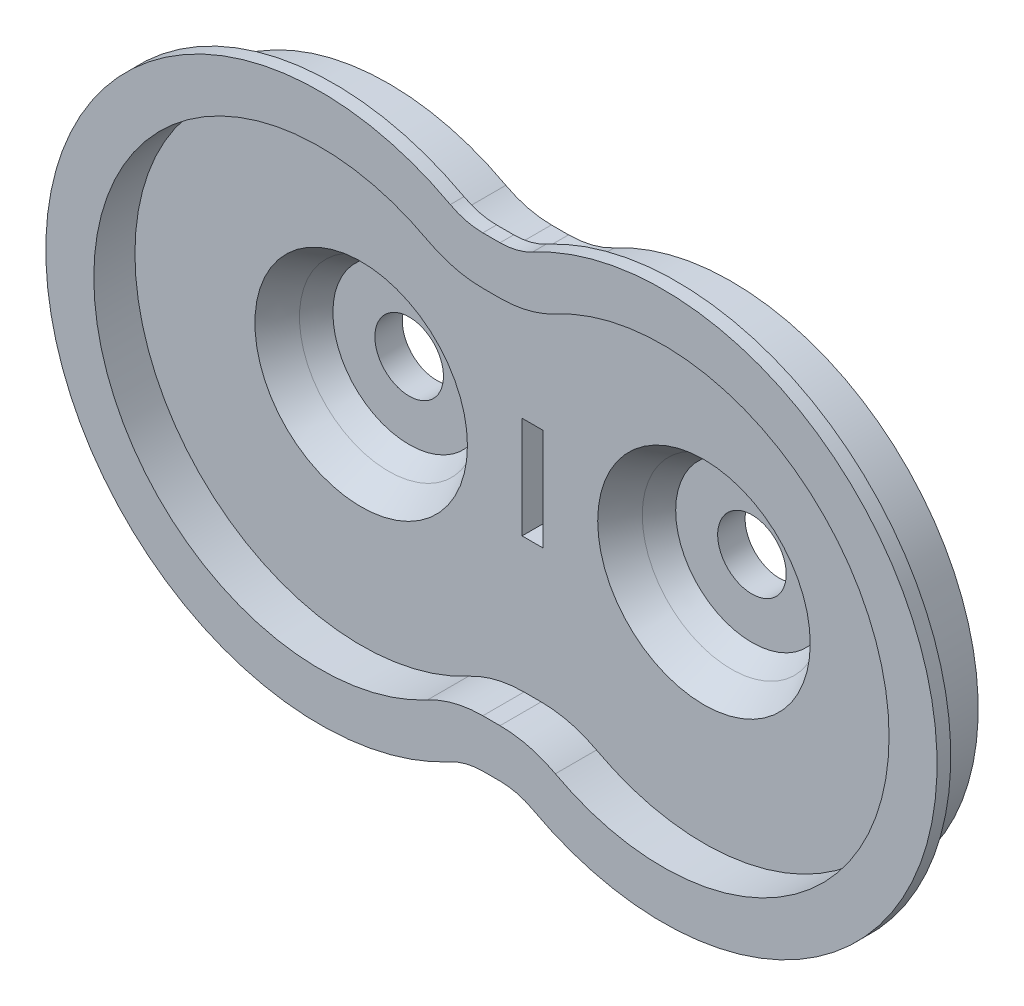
ISO-10303-21;
HEADER;
FILE_DESCRIPTION(('STEP AP214'),'2;1');
FILE_NAME('part.step','',(''),(''),'','','');
FILE_SCHEMA(('AUTOMOTIVE_DESIGN { 1 0 10303 214 1 1 1 1 }'));
ENDSEC;
DATA;
#1=APPLICATION_CONTEXT('core data for automotive mechanical design processes');
#2=APPLICATION_PROTOCOL_DEFINITION('international standard','automotive_design',2000,#1);
#3=PRODUCT_CONTEXT('',#1,'mechanical');
#4=PRODUCT('Part','Part','',(#3));
#5=PRODUCT_RELATED_PRODUCT_CATEGORY('part','',(#4));
#6=PRODUCT_DEFINITION_FORMATION('','',#4);
#7=PRODUCT_DEFINITION_CONTEXT('part definition',#1,'design');
#8=PRODUCT_DEFINITION('design','',#6,#7);
#9=PRODUCT_DEFINITION_SHAPE('','',#8);
#10=(LENGTH_UNIT() NAMED_UNIT(*) SI_UNIT(.MILLI.,.METRE.));
#11=(NAMED_UNIT(*) PLANE_ANGLE_UNIT() SI_UNIT($,.RADIAN.));
#12=(NAMED_UNIT(*) SI_UNIT($,.STERADIAN.) SOLID_ANGLE_UNIT());
#13=UNCERTAINTY_MEASURE_WITH_UNIT(LENGTH_MEASURE(1.E-05),#10,'distance_accuracy_value','');
#14=(GEOMETRIC_REPRESENTATION_CONTEXT(3) GLOBAL_UNCERTAINTY_ASSIGNED_CONTEXT((#13)) GLOBAL_UNIT_ASSIGNED_CONTEXT((#10,
#11,#12)) REPRESENTATION_CONTEXT('',''));
#15=CARTESIAN_POINT('',(0.,0.,0.));
#16=DIRECTION('',(0.,0.,1.));
#17=DIRECTION('',(1.,0.,0.));
#18=AXIS2_PLACEMENT_3D('',#15,#16,#17);
#19=CARTESIAN_POINT('',(0.625657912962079,22.,-4.));
#20=DIRECTION('',(0.,0.,1.));
#21=DIRECTION('',(1.,0.,0.));
#22=AXIS2_PLACEMENT_3D('',#19,#20,#21);
#23=CYLINDRICAL_SURFACE('',#22,7.00030465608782);
#24=DIRECTION('',(0.,0.,1.));
#25=VECTOR('',#24,1.);
#26=CARTESIAN_POINT('',(0.625657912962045,14.9996953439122,-4.));
#27=LINE('',#26,#25);
#28=CARTESIAN_POINT('',(0.625657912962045,14.9996953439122,-4.));
#29=VERTEX_POINT('',#28);
#30=CARTESIAN_POINT('',(0.625657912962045,14.9996953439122,0.));
#31=VERTEX_POINT('',#30);
#32=EDGE_CURVE('E428',#29,#31,#27,.T.);
#33=ORIENTED_EDGE('',*,*,#32,.T.);
#34=CARTESIAN_POINT('',(0.625657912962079,22.,0.));
#35=DIRECTION('',(0.,0.,-1.));
#36=DIRECTION('',(1.,0.,0.));
#37=AXIS2_PLACEMENT_3D('',#34,#35,#36);
#38=CIRCLE('',#37,7.00030465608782);
#39=CARTESIAN_POINT('',(3.95061840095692,15.8397319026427,0.));
#40=VERTEX_POINT('',#39);
#41=EDGE_CURVE('E314',#40,#31,#38,.T.);
#42=ORIENTED_EDGE('',*,*,#41,.F.);
#43=DIRECTION('',(0.,0.,1.));
#44=VECTOR('',#43,1.);
#45=CARTESIAN_POINT('',(3.95061840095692,15.8397319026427,-4.));
#46=LINE('',#45,#44);
#47=CARTESIAN_POINT('',(3.95061840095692,15.8397319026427,-4.));
#48=VERTEX_POINT('',#47);
#49=EDGE_CURVE('E458',#48,#40,#46,.T.);
#50=ORIENTED_EDGE('',*,*,#49,.F.);
#51=CARTESIAN_POINT('',(0.625657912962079,22.,-4.));
#52=DIRECTION('',(0.,0.,-1.));
#53=DIRECTION('',(1.,0.,0.));
#54=AXIS2_PLACEMENT_3D('',#51,#52,#53);
#55=CIRCLE('',#54,7.00030465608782);
#56=EDGE_CURVE('E35',#48,#29,#55,.T.);
#57=ORIENTED_EDGE('',*,*,#56,.T.);
#58=EDGE_LOOP('',(#33,#42,#50,#57));
#59=FACE_BOUND('',#58,.T.);
#60=ADVANCED_FACE('F31',(#59),#23,.F.);
#61=CARTESIAN_POINT('',(12.5,0.,-4.));
#62=DIRECTION('',(0.,0.,1.));
#63=DIRECTION('',(1.,0.,0.));
#64=AXIS2_PLACEMENT_3D('',#61,#62,#63);
#65=CYLINDRICAL_SURFACE('',#64,17.9996953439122);
#66=ORIENTED_EDGE('',*,*,#49,.T.);
#67=CARTESIAN_POINT('',(12.5,0.,0.));
#68=DIRECTION('',(0.,0.,1.));
#69=DIRECTION('',(1.,0.,0.));
#70=AXIS2_PLACEMENT_3D('',#67,#68,#69);
#71=CIRCLE('',#70,17.9996953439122);
#72=CARTESIAN_POINT('',(3.95061840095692,-15.8397319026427,0.));
#73=VERTEX_POINT('',#72);
#74=EDGE_CURVE('E328',#73,#40,#71,.T.);
#75=ORIENTED_EDGE('',*,*,#74,.F.);
#76=DIRECTION('',(0.,0.,1.));
#77=VECTOR('',#76,1.);
#78=CARTESIAN_POINT('',(3.95061840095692,-15.8397319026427,-4.));
#79=LINE('',#78,#77);
#80=CARTESIAN_POINT('',(3.95061840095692,-15.8397319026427,-4.));
#81=VERTEX_POINT('',#80);
#82=EDGE_CURVE('E454',#81,#73,#79,.T.);
#83=ORIENTED_EDGE('',*,*,#82,.F.);
#84=CARTESIAN_POINT('',(12.5,0.,-4.));
#85=DIRECTION('',(0.,0.,1.));
#86=DIRECTION('',(1.,0.,0.));
#87=AXIS2_PLACEMENT_3D('',#84,#85,#86);
#88=CIRCLE('',#87,17.9996953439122);
#89=EDGE_CURVE('E457',#81,#48,#88,.T.);
#90=ORIENTED_EDGE('',*,*,#89,.T.);
#91=EDGE_LOOP('',(#66,#75,#83,#90));
#92=FACE_BOUND('',#91,.T.);
#93=ADVANCED_FACE('F489',(#92),#65,.T.);
#94=CARTESIAN_POINT('',(0.625657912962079,-22.,-4.));
#95=DIRECTION('',(0.,0.,1.));
#96=DIRECTION('',(1.,0.,0.));
#97=AXIS2_PLACEMENT_3D('',#94,#95,#96);
#98=CYLINDRICAL_SURFACE('',#97,7.00030465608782);
#99=ORIENTED_EDGE('',*,*,#82,.T.);
#100=CARTESIAN_POINT('',(0.625657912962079,-22.,0.));
#101=DIRECTION('',(0.,0.,-1.));
#102=DIRECTION('',(1.,0.,0.));
#103=AXIS2_PLACEMENT_3D('',#100,#101,#102);
#104=CIRCLE('',#103,7.00030465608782);
#105=CARTESIAN_POINT('',(0.625657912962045,-14.9996953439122,0.));
#106=VERTEX_POINT('',#105);
#107=EDGE_CURVE('E326',#106,#73,#104,.T.);
#108=ORIENTED_EDGE('',*,*,#107,.F.);
#109=DIRECTION('',(0.,0.,1.));
#110=VECTOR('',#109,1.);
#111=CARTESIAN_POINT('',(0.625657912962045,-14.9996953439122,-4.));
#112=LINE('',#111,#110);
#113=CARTESIAN_POINT('',(0.625657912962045,-14.9996953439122,-4.));
#114=VERTEX_POINT('',#113);
#115=EDGE_CURVE('E450',#114,#106,#112,.T.);
#116=ORIENTED_EDGE('',*,*,#115,.F.);
#117=CARTESIAN_POINT('',(0.625657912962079,-22.,-4.));
#118=DIRECTION('',(0.,0.,-1.));
#119=DIRECTION('',(1.,0.,0.));
#120=AXIS2_PLACEMENT_3D('',#117,#118,#119);
#121=CIRCLE('',#120,7.00030465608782);
#122=EDGE_CURVE('E453',#114,#81,#121,.T.);
#123=ORIENTED_EDGE('',*,*,#122,.T.);
#124=EDGE_LOOP('',(#99,#108,#116,#123));
#125=FACE_BOUND('',#124,.T.);
#126=ADVANCED_FACE('F510',(#125),#98,.F.);
#127=CARTESIAN_POINT('',(-0.625657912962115,-14.9996953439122,-4.));
#128=DIRECTION('',(0.,-1.,0.));
#129=DIRECTION('',(1.,0.,0.));
#130=AXIS2_PLACEMENT_3D('',#127,#128,#129);
#131=PLANE('',#130);
#132=ORIENTED_EDGE('',*,*,#115,.T.);
#133=DIRECTION('',(1.,0.,0.));
#134=VECTOR('',#133,1.);
#135=CARTESIAN_POINT('',(-0.625657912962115,-14.9996953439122,0.));
#136=LINE('',#135,#134);
#137=CARTESIAN_POINT('',(-0.625657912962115,-14.9996953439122,0.));
#138=VERTEX_POINT('',#137);
#139=EDGE_CURVE('E324',#138,#106,#136,.T.);
#140=ORIENTED_EDGE('',*,*,#139,.F.);
#141=DIRECTION('',(0.,0.,1.));
#142=VECTOR('',#141,1.);
#143=CARTESIAN_POINT('',(-0.625657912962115,-14.9996953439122,-4.));
#144=LINE('',#143,#142);
#145=CARTESIAN_POINT('',(-0.625657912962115,-14.9996953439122,-4.));
#146=VERTEX_POINT('',#145);
#147=EDGE_CURVE('E446',#146,#138,#144,.T.);
#148=ORIENTED_EDGE('',*,*,#147,.F.);
#149=DIRECTION('',(1.,0.,0.));
#150=VECTOR('',#149,1.);
#151=CARTESIAN_POINT('',(-0.625657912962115,-14.9996953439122,-4.));
#152=LINE('',#151,#150);
#153=EDGE_CURVE('E449',#146,#114,#152,.T.);
#154=ORIENTED_EDGE('',*,*,#153,.T.);
#155=EDGE_LOOP('',(#132,#140,#148,#154));
#156=FACE_BOUND('',#155,.T.);
#157=ADVANCED_FACE('F495',(#156),#131,.T.);
#158=CARTESIAN_POINT('',(-0.625657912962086,-22.,-4.));
#159=DIRECTION('',(0.,0.,1.));
#160=DIRECTION('',(1.,0.,0.));
#161=AXIS2_PLACEMENT_3D('',#158,#159,#160);
#162=CYLINDRICAL_SURFACE('',#161,7.00030465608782);
#163=ORIENTED_EDGE('',*,*,#147,.T.);
#164=CARTESIAN_POINT('',(-0.625657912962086,-22.,0.));
#165=DIRECTION('',(0.,0.,-1.));
#166=DIRECTION('',(1.,0.,0.));
#167=AXIS2_PLACEMENT_3D('',#164,#165,#166);
#168=CIRCLE('',#167,7.00030465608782);
#169=CARTESIAN_POINT('',(-3.95061840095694,-15.8397319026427,0.));
#170=VERTEX_POINT('',#169);
#171=EDGE_CURVE('E322',#170,#138,#168,.T.);
#172=ORIENTED_EDGE('',*,*,#171,.F.);
#173=DIRECTION('',(0.,0.,1.));
#174=VECTOR('',#173,1.);
#175=CARTESIAN_POINT('',(-3.95061840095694,-15.8397319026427,-4.));
#176=LINE('',#175,#174);
#177=CARTESIAN_POINT('',(-3.95061840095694,-15.8397319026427,-4.));
#178=VERTEX_POINT('',#177);
#179=EDGE_CURVE('E442',#178,#170,#176,.T.);
#180=ORIENTED_EDGE('',*,*,#179,.F.);
#181=CARTESIAN_POINT('',(-0.625657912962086,-22.,-4.));
#182=DIRECTION('',(0.,0.,-1.));
#183=DIRECTION('',(1.,0.,0.));
#184=AXIS2_PLACEMENT_3D('',#181,#182,#183);
#185=CIRCLE('',#184,7.00030465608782);
#186=EDGE_CURVE('E445',#178,#146,#185,.T.);
#187=ORIENTED_EDGE('',*,*,#186,.T.);
#188=EDGE_LOOP('',(#163,#172,#180,#187));
#189=FACE_BOUND('',#188,.T.);
#190=ADVANCED_FACE('F499',(#189),#162,.F.);
#191=CARTESIAN_POINT('',(-12.5,0.,-4.));
#192=DIRECTION('',(0.,0.,1.));
#193=DIRECTION('',(1.,0.,0.));
#194=AXIS2_PLACEMENT_3D('',#191,#192,#193);
#195=CYLINDRICAL_SURFACE('',#194,17.9996953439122);
#196=ORIENTED_EDGE('',*,*,#179,.T.);
#197=CARTESIAN_POINT('',(-12.5,0.,0.));
#198=DIRECTION('',(0.,0.,1.));
#199=DIRECTION('',(1.,0.,0.));
#200=AXIS2_PLACEMENT_3D('',#197,#198,#199);
#201=CIRCLE('',#200,17.9996953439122);
#202=CARTESIAN_POINT('',(-3.95061840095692,15.8397319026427,0.));
#203=VERTEX_POINT('',#202);
#204=EDGE_CURVE('E320',#203,#170,#201,.T.);
#205=ORIENTED_EDGE('',*,*,#204,.F.);
#206=DIRECTION('',(0.,0.,1.));
#207=VECTOR('',#206,1.);
#208=CARTESIAN_POINT('',(-3.95061840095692,15.8397319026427,-4.));
#209=LINE('',#208,#207);
#210=CARTESIAN_POINT('',(-3.95061840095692,15.8397319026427,-4.));
#211=VERTEX_POINT('',#210);
#212=EDGE_CURVE('E438',#211,#203,#209,.T.);
#213=ORIENTED_EDGE('',*,*,#212,.F.);
#214=CARTESIAN_POINT('',(-12.5,0.,-4.));
#215=DIRECTION('',(0.,0.,1.));
#216=DIRECTION('',(1.,0.,0.));
#217=AXIS2_PLACEMENT_3D('',#214,#215,#216);
#218=CIRCLE('',#217,17.9996953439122);
#219=EDGE_CURVE('E441',#211,#178,#218,.T.);
#220=ORIENTED_EDGE('',*,*,#219,.T.);
#221=EDGE_LOOP('',(#196,#205,#213,#220));
#222=FACE_BOUND('',#221,.T.);
#223=ADVANCED_FACE('F501',(#222),#195,.T.);
#224=CARTESIAN_POINT('',(-0.625657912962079,22.,-4.));
#225=DIRECTION('',(0.,0.,1.));
#226=DIRECTION('',(1.,0.,0.));
#227=AXIS2_PLACEMENT_3D('',#224,#225,#226);
#228=CYLINDRICAL_SURFACE('',#227,7.00030465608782);
#229=ORIENTED_EDGE('',*,*,#212,.T.);
#230=CARTESIAN_POINT('',(-0.625657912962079,22.,0.));
#231=DIRECTION('',(0.,0.,-1.));
#232=DIRECTION('',(1.,0.,0.));
#233=AXIS2_PLACEMENT_3D('',#230,#231,#232);
#234=CIRCLE('',#233,7.00030465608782);
#235=CARTESIAN_POINT('',(-0.625657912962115,14.9996953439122,0.));
#236=VERTEX_POINT('',#235);
#237=EDGE_CURVE('E318',#236,#203,#234,.T.);
#238=ORIENTED_EDGE('',*,*,#237,.F.);
#239=DIRECTION('',(0.,0.,1.));
#240=VECTOR('',#239,1.);
#241=CARTESIAN_POINT('',(-0.625657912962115,14.9996953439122,-4.));
#242=LINE('',#241,#240);
#243=CARTESIAN_POINT('',(-0.625657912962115,14.9996953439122,-4.));
#244=VERTEX_POINT('',#243);
#245=EDGE_CURVE('E434',#244,#236,#242,.T.);
#246=ORIENTED_EDGE('',*,*,#245,.F.);
#247=CARTESIAN_POINT('',(-0.625657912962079,22.,-4.));
#248=DIRECTION('',(0.,0.,-1.));
#249=DIRECTION('',(1.,0.,0.));
#250=AXIS2_PLACEMENT_3D('',#247,#248,#249);
#251=CIRCLE('',#250,7.00030465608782);
#252=EDGE_CURVE('E437',#244,#211,#251,.T.);
#253=ORIENTED_EDGE('',*,*,#252,.T.);
#254=EDGE_LOOP('',(#229,#238,#246,#253));
#255=FACE_BOUND('',#254,.T.);
#256=ADVANCED_FACE('F505',(#255),#228,.F.);
#257=CARTESIAN_POINT('',(0.625657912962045,14.9996953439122,-4.));
#258=DIRECTION('',(0.,1.,0.));
#259=DIRECTION('',(-1.,0.,0.));
#260=AXIS2_PLACEMENT_3D('',#257,#258,#259);
#261=PLANE('',#260);
#262=ORIENTED_EDGE('',*,*,#245,.T.);
#263=DIRECTION('',(-1.,0.,0.));
#264=VECTOR('',#263,1.);
#265=CARTESIAN_POINT('',(0.625657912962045,14.9996953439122,0.));
#266=LINE('',#265,#264);
#267=EDGE_CURVE('E316',#31,#236,#266,.T.);
#268=ORIENTED_EDGE('',*,*,#267,.F.);
#269=ORIENTED_EDGE('',*,*,#32,.F.);
#270=DIRECTION('',(-1.,0.,0.));
#271=VECTOR('',#270,1.);
#272=CARTESIAN_POINT('',(0.625657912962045,14.9996953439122,-4.));
#273=LINE('',#272,#271);
#274=EDGE_CURVE('E431',#29,#244,#273,.T.);
#275=ORIENTED_EDGE('',*,*,#274,.T.);
#276=EDGE_LOOP('',(#262,#268,#269,#275));
#277=FACE_BOUND('',#276,.T.);
#278=ADVANCED_FACE('F475',(#277),#261,.T.);
#279=CARTESIAN_POINT('',(0.625657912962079,22.,-4.));
#280=DIRECTION('',(0.,0.,1.));
#281=DIRECTION('',(1.,0.,0.));
#282=AXIS2_PLACEMENT_3D('',#279,#280,#281);
#283=PLANE('',#282);
#284=DIRECTION('',(-1.,0.,0.));
#285=VECTOR('',#284,1.);
#286=CARTESIAN_POINT('',(0.625657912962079,3.72250644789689,-4.));
#287=LINE('',#286,#285);
#288=CARTESIAN_POINT('',(0.771521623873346,3.72250644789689,-4.));
#289=VERTEX_POINT('',#288);
#290=CARTESIAN_POINT('',(-0.763931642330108,3.72250644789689,-4.));
#291=VERTEX_POINT('',#290);
#292=EDGE_CURVE('E248',#289,#291,#287,.T.);
#293=ORIENTED_EDGE('',*,*,#292,.T.);
#294=DIRECTION('',(0.,-1.,0.));
#295=VECTOR('',#294,1.);
#296=CARTESIAN_POINT('',(-0.763931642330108,22.,-4.));
#297=LINE('',#296,#295);
#298=CARTESIAN_POINT('',(-0.763931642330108,-3.70960347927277,-4.));
#299=VERTEX_POINT('',#298);
#300=EDGE_CURVE('E251',#291,#299,#297,.T.);
#301=ORIENTED_EDGE('',*,*,#300,.T.);
#302=DIRECTION('',(1.,0.,0.));
#303=VECTOR('',#302,1.);
#304=CARTESIAN_POINT('',(0.625657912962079,-3.70960347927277,-4.));
#305=LINE('',#304,#303);
#306=CARTESIAN_POINT('',(0.771521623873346,-3.70960347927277,-4.));
#307=VERTEX_POINT('',#306);
#308=EDGE_CURVE('E243',#299,#307,#305,.T.);
#309=ORIENTED_EDGE('',*,*,#308,.T.);
#310=DIRECTION('',(0.,1.,0.));
#311=VECTOR('',#310,1.);
#312=CARTESIAN_POINT('',(0.771521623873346,22.,-4.));
#313=LINE('',#312,#311);
#314=EDGE_CURVE('E224',#307,#289,#313,.T.);
#315=ORIENTED_EDGE('',*,*,#314,.T.);
#316=EDGE_LOOP('',(#293,#301,#309,#315));
#317=FACE_BOUND('',#316,.T.);
#318=CARTESIAN_POINT('',(-12.5,0.,-4.));
#319=DIRECTION('',(0.,0.,1.));
#320=DIRECTION('',(1.,0.,0.));
#321=AXIS2_PLACEMENT_3D('',#318,#319,#320);
#322=CIRCLE('',#321,8.85849528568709);
#323=CARTESIAN_POINT('',(-3.64150471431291,0.,-4.));
#324=VERTEX_POINT('',#323);
#325=EDGE_CURVE('E40',#324,#324,#322,.F.);
#326=ORIENTED_EDGE('',*,*,#325,.F.);
#327=EDGE_LOOP('',(#326));
#328=FACE_BOUND('',#327,.T.);
#329=ORIENTED_EDGE('',*,*,#56,.F.);
#330=ORIENTED_EDGE('',*,*,#89,.F.);
#331=ORIENTED_EDGE('',*,*,#122,.F.);
#332=ORIENTED_EDGE('',*,*,#153,.F.);
#333=ORIENTED_EDGE('',*,*,#186,.F.);
#334=ORIENTED_EDGE('',*,*,#219,.F.);
#335=ORIENTED_EDGE('',*,*,#252,.F.);
#336=ORIENTED_EDGE('',*,*,#274,.F.);
#337=EDGE_LOOP('',(#329,#330,#331,#332,#333,#334,#335,#336));
#338=FACE_BOUND('',#337,.T.);
#339=CARTESIAN_POINT('',(12.5,0.,-4.));
#340=DIRECTION('',(0.,0.,1.));
#341=DIRECTION('',(1.,0.,0.));
#342=AXIS2_PLACEMENT_3D('',#339,#340,#341);
#343=CIRCLE('',#342,8.85849528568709);
#344=CARTESIAN_POINT('',(21.3584952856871,0.,-4.));
#345=VERTEX_POINT('',#344);
#346=EDGE_CURVE('E11',#345,#345,#343,.F.);
#347=ORIENTED_EDGE('',*,*,#346,.F.);
#348=EDGE_LOOP('',(#347));
#349=FACE_BOUND('',#348,.T.);
#350=ADVANCED_FACE('F481',(#317,#328,#338,#349),#283,.F.);
#351=CARTESIAN_POINT('',(0.,-55.2341929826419,-2.));
#352=DIRECTION('',(0.,0.,1.));
#353=DIRECTION('',(1.,0.,0.));
#354=AXIS2_PLACEMENT_3D('',#351,#352,#353);
#355=PLANE('',#354);
#356=DIRECTION('',(0.,-1.,0.));
#357=VECTOR('',#356,1.);
#358=CARTESIAN_POINT('',(-0.763931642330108,3.72250644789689,-2.));
#359=LINE('',#358,#357);
#360=CARTESIAN_POINT('',(-0.763931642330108,3.72250644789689,-2.));
#361=VERTEX_POINT('',#360);
#362=CARTESIAN_POINT('',(-0.763931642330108,-3.70960347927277,-2.));
#363=VERTEX_POINT('',#362);
#364=EDGE_CURVE('E56',#361,#363,#359,.T.);
#365=ORIENTED_EDGE('',*,*,#364,.F.);
#366=DIRECTION('',(-1.,0.,0.));
#367=VECTOR('',#366,1.);
#368=CARTESIAN_POINT('',(-0.763931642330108,3.72250644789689,-2.));
#369=LINE('',#368,#367);
#370=CARTESIAN_POINT('',(0.771521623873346,3.72250644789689,-2.));
#371=VERTEX_POINT('',#370);
#372=EDGE_CURVE('E236',#371,#361,#369,.T.);
#373=ORIENTED_EDGE('',*,*,#372,.F.);
#374=DIRECTION('',(0.,1.,0.));
#375=VECTOR('',#374,1.);
#376=CARTESIAN_POINT('',(0.771521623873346,3.72250644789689,-2.));
#377=LINE('',#376,#375);
#378=CARTESIAN_POINT('',(0.771521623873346,-3.70960347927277,-2.));
#379=VERTEX_POINT('',#378);
#380=EDGE_CURVE('E221',#379,#371,#377,.T.);
#381=ORIENTED_EDGE('',*,*,#380,.F.);
#382=DIRECTION('',(1.,0.,0.));
#383=VECTOR('',#382,1.);
#384=CARTESIAN_POINT('',(-0.763931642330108,-3.70960347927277,-2.));
#385=LINE('',#384,#383);
#386=EDGE_CURVE('E230',#363,#379,#385,.T.);
#387=ORIENTED_EDGE('',*,*,#386,.F.);
#388=EDGE_LOOP('',(#365,#373,#381,#387));
#389=FACE_BOUND('',#388,.T.);
#390=CARTESIAN_POINT('',(12.5,0.,-2.));
#391=DIRECTION('',(0.,0.,1.));
#392=DIRECTION('',(1.,0.,0.));
#393=AXIS2_PLACEMENT_3D('',#390,#391,#392);
#394=CIRCLE('',#393,16.4996953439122);
#395=CARTESIAN_POINT('',(4.6630789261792,-14.5197319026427,-2.));
#396=VERTEX_POINT('',#395);
#397=CARTESIAN_POINT('',(4.6630789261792,14.5197319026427,-2.));
#398=VERTEX_POINT('',#397);
#399=EDGE_CURVE('E334',#396,#398,#394,.T.);
#400=ORIENTED_EDGE('',*,*,#399,.T.);
#401=CARTESIAN_POINT('',(0.625657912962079,22.,-2.));
#402=DIRECTION('',(0.,0.,1.));
#403=DIRECTION('',(1.,0.,0.));
#404=AXIS2_PLACEMENT_3D('',#401,#402,#403);
#405=CIRCLE('',#404,8.50030465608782);
#406=CARTESIAN_POINT('',(0.625657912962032,13.4996953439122,-2.));
#407=VERTEX_POINT('',#406);
#408=EDGE_CURVE('E331',#407,#398,#405,.T.);
#409=ORIENTED_EDGE('',*,*,#408,.F.);
#410=DIRECTION('',(-1.,0.,0.));
#411=VECTOR('',#410,1.);
#412=CARTESIAN_POINT('',(0.,13.4996953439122,-2.));
#413=LINE('',#412,#411);
#414=CARTESIAN_POINT('',(-0.625657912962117,13.4996953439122,-2.));
#415=VERTEX_POINT('',#414);
#416=EDGE_CURVE('E336',#407,#415,#413,.T.);
#417=ORIENTED_EDGE('',*,*,#416,.T.);
#418=CARTESIAN_POINT('',(-0.625657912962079,22.,-2.));
#419=DIRECTION('',(0.,0.,1.));
#420=DIRECTION('',(1.,0.,0.));
#421=AXIS2_PLACEMENT_3D('',#418,#419,#420);
#422=CIRCLE('',#421,8.50030465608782);
#423=CARTESIAN_POINT('',(-4.66307892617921,14.5197319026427,-2.));
#424=VERTEX_POINT('',#423);
#425=EDGE_CURVE('E340',#424,#415,#422,.T.);
#426=ORIENTED_EDGE('',*,*,#425,.F.);
#427=CARTESIAN_POINT('',(-12.5,0.,-2.));
#428=DIRECTION('',(0.,0.,1.));
#429=DIRECTION('',(1.,0.,0.));
#430=AXIS2_PLACEMENT_3D('',#427,#428,#429);
#431=CIRCLE('',#430,16.4996953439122);
#432=CARTESIAN_POINT('',(-4.66307892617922,-14.5197319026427,-2.));
#433=VERTEX_POINT('',#432);
#434=EDGE_CURVE('E339',#424,#433,#431,.T.);
#435=ORIENTED_EDGE('',*,*,#434,.T.);
#436=CARTESIAN_POINT('',(-0.625657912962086,-22.,-2.));
#437=DIRECTION('',(0.,0.,1.));
#438=DIRECTION('',(1.,0.,0.));
#439=AXIS2_PLACEMENT_3D('',#436,#437,#438);
#440=CIRCLE('',#439,8.50030465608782);
#441=CARTESIAN_POINT('',(-0.625657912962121,-13.4996953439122,-2.));
#442=VERTEX_POINT('',#441);
#443=EDGE_CURVE('E348',#442,#433,#440,.T.);
#444=ORIENTED_EDGE('',*,*,#443,.F.);
#445=DIRECTION('',(1.,0.,0.));
#446=VECTOR('',#445,1.);
#447=CARTESIAN_POINT('',(0.,-13.4996953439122,-2.));
#448=LINE('',#447,#446);
#449=CARTESIAN_POINT('',(0.625657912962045,-13.4996953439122,-2.));
#450=VERTEX_POINT('',#449);
#451=EDGE_CURVE('E347',#442,#450,#448,.T.);
#452=ORIENTED_EDGE('',*,*,#451,.T.);
#453=CARTESIAN_POINT('',(0.625657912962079,-22.,-2.));
#454=DIRECTION('',(0.,0.,1.));
#455=DIRECTION('',(1.,0.,0.));
#456=AXIS2_PLACEMENT_3D('',#453,#454,#455);
#457=CIRCLE('',#456,8.50030465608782);
#458=EDGE_CURVE('E356',#396,#450,#457,.T.);
#459=ORIENTED_EDGE('',*,*,#458,.F.);
#460=EDGE_LOOP('',(#400,#409,#417,#426,#435,#444,#452,#459));
#461=FACE_BOUND('',#460,.T.);
#462=CARTESIAN_POINT('',(12.5,0.,-2.));
#463=DIRECTION('',(0.,0.,1.));
#464=DIRECTION('',(1.,0.,0.));
#465=AXIS2_PLACEMENT_3D('',#462,#463,#464);
#466=CIRCLE('',#465,7.75);
#467=CARTESIAN_POINT('',(20.25,0.,-2.));
#468=VERTEX_POINT('',#467);
#469=EDGE_CURVE('E395',#468,#468,#466,.T.);
#470=ORIENTED_EDGE('',*,*,#469,.F.);
#471=EDGE_LOOP('',(#470));
#472=FACE_BOUND('',#471,.T.);
#473=CARTESIAN_POINT('',(-12.5,0.,-2.));
#474=DIRECTION('',(0.,0.,1.));
#475=DIRECTION('',(1.,0.,0.));
#476=AXIS2_PLACEMENT_3D('',#473,#474,#475);
#477=CIRCLE('',#476,7.75);
#478=CARTESIAN_POINT('',(-4.75,0.,-2.));
#479=VERTEX_POINT('',#478);
#480=EDGE_CURVE('E401',#479,#479,#477,.T.);
#481=ORIENTED_EDGE('',*,*,#480,.F.);
#482=EDGE_LOOP('',(#481));
#483=FACE_BOUND('',#482,.T.);
#484=ADVANCED_FACE('F33',(#389,#461,#472,#483),#355,.T.);
#485=CARTESIAN_POINT('',(-12.5,0.,-2.));
#486=DIRECTION('',(0.,0.,1.));
#487=DIRECTION('',(1.,0.,0.));
#488=AXIS2_PLACEMENT_3D('',#485,#486,#487);
#489=CONICAL_SURFACE('',#488,10.10849528,0.558599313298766);
#490=CARTESIAN_POINT('',(-12.5,0.,-7.5));
#491=DIRECTION('',(0.,0.,-1.));
#492=DIRECTION('',(-1.,0.,0.));
#493=AXIS2_PLACEMENT_3D('',#490,#491,#492);
#494=CIRCLE('',#493,6.6709952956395);
#495=CARTESIAN_POINT('',(-19.1709952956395,0.,-7.5));
#496=VERTEX_POINT('',#495);
#497=EDGE_CURVE('E425',#496,#496,#494,.T.);
#498=ORIENTED_EDGE('',*,*,#497,.F.);
#499=EDGE_LOOP('',(#498));
#500=FACE_BOUND('',#499,.T.);
#501=ORIENTED_EDGE('',*,*,#325,.T.);
#502=EDGE_LOOP('',(#501));
#503=FACE_BOUND('',#502,.T.);
#504=ADVANCED_FACE('F564',(#500,#503),#489,.T.);
#505=CARTESIAN_POINT('',(-12.5,0.,-5.5));
#506=DIRECTION('',(0.,0.,1.));
#507=DIRECTION('',(1.,0.,0.));
#508=AXIS2_PLACEMENT_3D('',#505,#506,#507);
#509=CONICAL_SURFACE('',#508,5.56250000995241,0.558599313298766);
#510=CARTESIAN_POINT('',(-12.5,0.,-5.5));
#511=DIRECTION('',(0.,0.,-1.));
#512=DIRECTION('',(-1.,0.,0.));
#513=AXIS2_PLACEMENT_3D('',#510,#511,#512);
#514=CIRCLE('',#513,5.56250000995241);
#515=CARTESIAN_POINT('',(-18.0625000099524,0.,-5.5));
#516=VERTEX_POINT('',#515);
#517=EDGE_CURVE('E415',#516,#516,#514,.T.);
#518=ORIENTED_EDGE('',*,*,#517,.T.);
#519=EDGE_LOOP('',(#518));
#520=FACE_BOUND('',#519,.T.);
#521=CARTESIAN_POINT('',(-12.5,0.,-4.));
#522=DIRECTION('',(0.,0.,1.));
#523=DIRECTION('',(1.,0.,0.));
#524=AXIS2_PLACEMENT_3D('',#521,#522,#523);
#525=CIRCLE('',#524,6.5);
#526=CARTESIAN_POINT('',(-6.,0.,-4.));
#527=VERTEX_POINT('',#526);
#528=EDGE_CURVE('E398',#527,#527,#525,.T.);
#529=ORIENTED_EDGE('',*,*,#528,.T.);
#530=EDGE_LOOP('',(#529));
#531=FACE_BOUND('',#530,.T.);
#532=ADVANCED_FACE('F525',(#520,#531),#509,.F.);
#533=CARTESIAN_POINT('',(-10.,0.,-7.5));
#534=DIRECTION('',(0.,0.,1.));
#535=DIRECTION('',(1.,0.,0.));
#536=AXIS2_PLACEMENT_3D('',#533,#534,#535);
#537=PLANE('',#536);
#538=CARTESIAN_POINT('',(-12.5,0.,-7.5));
#539=DIRECTION('',(0.,0.,-1.));
#540=DIRECTION('',(-1.,0.,0.));
#541=AXIS2_PLACEMENT_3D('',#538,#539,#540);
#542=CIRCLE('',#541,2.5);
#543=CARTESIAN_POINT('',(-15.,0.,-7.5));
#544=VERTEX_POINT('',#543);
#545=EDGE_CURVE('E422',#544,#544,#542,.T.);
#546=ORIENTED_EDGE('',*,*,#545,.F.);
#547=EDGE_LOOP('',(#546));
#548=FACE_BOUND('',#547,.T.);
#549=ORIENTED_EDGE('',*,*,#497,.T.);
#550=EDGE_LOOP('',(#549));
#551=FACE_BOUND('',#550,.T.);
#552=ADVANCED_FACE('F577',(#548,#551),#537,.F.);
#553=CARTESIAN_POINT('',(-12.5,0.,-2.));
#554=DIRECTION('',(0.,0.,-1.));
#555=DIRECTION('',(-1.,0.,0.));
#556=AXIS2_PLACEMENT_3D('',#553,#554,#555);
#557=CYLINDRICAL_SURFACE('',#556,2.5);
#558=CARTESIAN_POINT('',(-12.5,0.,-5.5));
#559=DIRECTION('',(0.,0.,-1.));
#560=DIRECTION('',(-1.,0.,0.));
#561=AXIS2_PLACEMENT_3D('',#558,#559,#560);
#562=CIRCLE('',#561,2.5);
#563=CARTESIAN_POINT('',(-15.,0.,-5.5));
#564=VERTEX_POINT('',#563);
#565=EDGE_CURVE('E419',#564,#564,#562,.T.);
#566=ORIENTED_EDGE('',*,*,#565,.F.);
#567=EDGE_LOOP('',(#566));
#568=FACE_BOUND('',#567,.T.);
#569=ORIENTED_EDGE('',*,*,#545,.T.);
#570=EDGE_LOOP('',(#569));
#571=FACE_BOUND('',#570,.T.);
#572=ADVANCED_FACE('F584',(#568,#571),#557,.F.);
#573=CARTESIAN_POINT('',(-10.,0.,-5.5));
#574=DIRECTION('',(0.,0.,-1.));
#575=DIRECTION('',(-1.,0.,0.));
#576=AXIS2_PLACEMENT_3D('',#573,#574,#575);
#577=PLANE('',#576);
#578=ORIENTED_EDGE('',*,*,#517,.F.);
#579=EDGE_LOOP('',(#578));
#580=FACE_BOUND('',#579,.T.);
#581=ORIENTED_EDGE('',*,*,#565,.T.);
#582=EDGE_LOOP('',(#581));
#583=FACE_BOUND('',#582,.T.);
#584=ADVANCED_FACE('F592',(#580,#583),#577,.F.);
#585=CARTESIAN_POINT('',(12.5,0.,-2.));
#586=DIRECTION('',(0.,0.,1.));
#587=DIRECTION('',(-1.,0.,0.));
#588=AXIS2_PLACEMENT_3D('',#585,#586,#587);
#589=CONICAL_SURFACE('',#588,10.10849528,0.558599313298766);
#590=CARTESIAN_POINT('',(12.5,0.,-7.5));
#591=DIRECTION('',(0.,0.,1.));
#592=DIRECTION('',(1.,0.,0.));
#593=AXIS2_PLACEMENT_3D('',#590,#591,#592);
#594=CIRCLE('',#593,6.6709952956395);
#595=CARTESIAN_POINT('',(19.1709952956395,0.,-7.5));
#596=VERTEX_POINT('',#595);
#597=EDGE_CURVE('E413',#596,#596,#594,.T.);
#598=ORIENTED_EDGE('',*,*,#597,.T.);
#599=EDGE_LOOP('',(#598));
#600=FACE_BOUND('',#599,.T.);
#601=ORIENTED_EDGE('',*,*,#346,.T.);
#602=EDGE_LOOP('',(#601));
#603=FACE_BOUND('',#602,.T.);
#604=ADVANCED_FACE('F600',(#600,#603),#589,.T.);
#605=CARTESIAN_POINT('',(12.5,0.,-5.5));
#606=DIRECTION('',(0.,0.,1.));
#607=DIRECTION('',(-1.,0.,0.));
#608=AXIS2_PLACEMENT_3D('',#605,#606,#607);
#609=CONICAL_SURFACE('',#608,5.56250000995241,0.558599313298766);
#610=CARTESIAN_POINT('',(12.5,0.,-5.5));
#611=DIRECTION('',(0.,0.,1.));
#612=DIRECTION('',(1.,0.,0.));
#613=AXIS2_PLACEMENT_3D('',#610,#611,#612);
#614=CIRCLE('',#613,5.56250000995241);
#615=CARTESIAN_POINT('',(18.0625000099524,0.,-5.5));
#616=VERTEX_POINT('',#615);
#617=EDGE_CURVE('E404',#616,#616,#614,.T.);
#618=ORIENTED_EDGE('',*,*,#617,.F.);
#619=EDGE_LOOP('',(#618));
#620=FACE_BOUND('',#619,.T.);
#621=CARTESIAN_POINT('',(12.5,0.,-4.));
#622=DIRECTION('',(0.,0.,-1.));
#623=DIRECTION('',(-1.,0.,0.));
#624=AXIS2_PLACEMENT_3D('',#621,#622,#623);
#625=CIRCLE('',#624,6.5);
#626=CARTESIAN_POINT('',(6.,0.,-4.));
#627=VERTEX_POINT('',#626);
#628=EDGE_CURVE('E383',#627,#627,#625,.T.);
#629=ORIENTED_EDGE('',*,*,#628,.F.);
#630=EDGE_LOOP('',(#629));
#631=FACE_BOUND('',#630,.T.);
#632=ADVANCED_FACE('F608',(#620,#631),#609,.F.);
#633=CARTESIAN_POINT('',(10.,0.,-7.5));
#634=DIRECTION('',(0.,0.,1.));
#635=DIRECTION('',(-1.,0.,0.));
#636=AXIS2_PLACEMENT_3D('',#633,#634,#635);
#637=PLANE('',#636);
#638=CARTESIAN_POINT('',(12.5,0.,-7.5));
#639=DIRECTION('',(0.,0.,1.));
#640=DIRECTION('',(1.,0.,0.));
#641=AXIS2_PLACEMENT_3D('',#638,#639,#640);
#642=CIRCLE('',#641,2.5);
#643=CARTESIAN_POINT('',(15.,0.,-7.5));
#644=VERTEX_POINT('',#643);
#645=EDGE_CURVE('E410',#644,#644,#642,.T.);
#646=ORIENTED_EDGE('',*,*,#645,.T.);
#647=EDGE_LOOP('',(#646));
#648=FACE_BOUND('',#647,.T.);
#649=ORIENTED_EDGE('',*,*,#597,.F.);
#650=EDGE_LOOP('',(#649));
#651=FACE_BOUND('',#650,.T.);
#652=ADVANCED_FACE('F616',(#648,#651),#637,.F.);
#653=CARTESIAN_POINT('',(12.5,0.,-2.));
#654=DIRECTION('',(0.,0.,-1.));
#655=DIRECTION('',(1.,0.,0.));
#656=AXIS2_PLACEMENT_3D('',#653,#654,#655);
#657=CYLINDRICAL_SURFACE('',#656,2.5);
#658=CARTESIAN_POINT('',(12.5,0.,-5.5));
#659=DIRECTION('',(0.,0.,1.));
#660=DIRECTION('',(1.,0.,0.));
#661=AXIS2_PLACEMENT_3D('',#658,#659,#660);
#662=CIRCLE('',#661,2.5);
#663=CARTESIAN_POINT('',(15.,0.,-5.5));
#664=VERTEX_POINT('',#663);
#665=EDGE_CURVE('E407',#664,#664,#662,.T.);
#666=ORIENTED_EDGE('',*,*,#665,.T.);
#667=EDGE_LOOP('',(#666));
#668=FACE_BOUND('',#667,.T.);
#669=ORIENTED_EDGE('',*,*,#645,.F.);
#670=EDGE_LOOP('',(#669));
#671=FACE_BOUND('',#670,.T.);
#672=ADVANCED_FACE('F624',(#668,#671),#657,.F.);
#673=CARTESIAN_POINT('',(10.,0.,-5.5));
#674=DIRECTION('',(0.,0.,-1.));
#675=DIRECTION('',(1.,0.,0.));
#676=AXIS2_PLACEMENT_3D('',#673,#674,#675);
#677=PLANE('',#676);
#678=ORIENTED_EDGE('',*,*,#617,.T.);
#679=EDGE_LOOP('',(#678));
#680=FACE_BOUND('',#679,.T.);
#681=ORIENTED_EDGE('',*,*,#665,.F.);
#682=EDGE_LOOP('',(#681));
#683=FACE_BOUND('',#682,.T.);
#684=ADVANCED_FACE('F632',(#680,#683),#677,.F.);
#685=CARTESIAN_POINT('',(-12.5,0.,1.));
#686=DIRECTION('',(0.,0.,1.));
#687=DIRECTION('',(1.,0.,0.));
#688=AXIS2_PLACEMENT_3D('',#685,#686,#687);
#689=CONICAL_SURFACE('',#688,9.625,0.558599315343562);
#690=ORIENTED_EDGE('',*,*,#480,.T.);
#691=EDGE_LOOP('',(#690));
#692=FACE_BOUND('',#691,.T.);
#693=ORIENTED_EDGE('',*,*,#528,.F.);
#694=EDGE_LOOP('',(#693));
#695=FACE_BOUND('',#694,.T.);
#696=ADVANCED_FACE('F640',(#692,#695),#689,.F.);
#697=CARTESIAN_POINT('',(12.5,0.,1.));
#698=DIRECTION('',(0.,0.,1.));
#699=DIRECTION('',(-1.,0.,0.));
#700=AXIS2_PLACEMENT_3D('',#697,#698,#699);
#701=CONICAL_SURFACE('',#700,9.625,0.558599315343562);
#702=ORIENTED_EDGE('',*,*,#469,.T.);
#703=EDGE_LOOP('',(#702));
#704=FACE_BOUND('',#703,.T.);
#705=ORIENTED_EDGE('',*,*,#628,.T.);
#706=EDGE_LOOP('',(#705));
#707=FACE_BOUND('',#706,.T.);
#708=ADVANCED_FACE('F648',(#704,#707),#701,.F.);
#709=CARTESIAN_POINT('',(12.5,0.,71.8299498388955));
#710=DIRECTION('',(0.,0.,-1.));
#711=DIRECTION('',(-1.,0.,0.));
#712=AXIS2_PLACEMENT_3D('',#709,#710,#711);
#713=CYLINDRICAL_SURFACE('',#712,16.4996953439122);
#714=DIRECTION('',(0.,0.,-1.));
#715=VECTOR('',#714,1.);
#716=CARTESIAN_POINT('',(4.6630789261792,-14.5197319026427,71.8299498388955));
#717=LINE('',#716,#715);
#718=CARTESIAN_POINT('',(4.6630789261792,-14.5197319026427,1.));
#719=VERTEX_POINT('',#718);
#720=EDGE_CURVE('E360',#719,#396,#717,.T.);
#721=ORIENTED_EDGE('',*,*,#720,.F.);
#722=CARTESIAN_POINT('',(12.5,0.,1.));
#723=DIRECTION('',(0.,0.,1.));
#724=DIRECTION('',(1.,0.,0.));
#725=AXIS2_PLACEMENT_3D('',#722,#723,#724);
#726=CIRCLE('',#725,16.4996953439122);
#727=CARTESIAN_POINT('',(4.6630789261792,14.5197319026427,1.));
#728=VERTEX_POINT('',#727);
#729=EDGE_CURVE('E330',#719,#728,#726,.T.);
#730=ORIENTED_EDGE('',*,*,#729,.T.);
#731=DIRECTION('',(0.,0.,-1.));
#732=VECTOR('',#731,1.);
#733=CARTESIAN_POINT('',(4.6630789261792,14.5197319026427,71.8299498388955));
#734=LINE('',#733,#732);
#735=EDGE_CURVE('E380',#728,#398,#734,.T.);
#736=ORIENTED_EDGE('',*,*,#735,.T.);
#737=ORIENTED_EDGE('',*,*,#399,.F.);
#738=EDGE_LOOP('',(#721,#730,#736,#737));
#739=FACE_BOUND('',#738,.T.);
#740=ADVANCED_FACE('F656',(#739),#713,.F.);
#741=CARTESIAN_POINT('',(0.625657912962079,-22.,71.8299498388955));
#742=DIRECTION('',(0.,0.,-1.));
#743=DIRECTION('',(-1.,0.,0.));
#744=AXIS2_PLACEMENT_3D('',#741,#742,#743);
#745=CYLINDRICAL_SURFACE('',#744,8.50030465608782);
#746=CARTESIAN_POINT('',(0.625657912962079,-22.,1.));
#747=DIRECTION('',(0.,0.,1.));
#748=DIRECTION('',(1.,0.,0.));
#749=AXIS2_PLACEMENT_3D('',#746,#747,#748);
#750=CIRCLE('',#749,8.50030465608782);
#751=CARTESIAN_POINT('',(0.625657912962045,-13.4996953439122,1.));
#752=VERTEX_POINT('',#751);
#753=EDGE_CURVE('E355',#719,#752,#750,.T.);
#754=ORIENTED_EDGE('',*,*,#753,.F.);
#755=ORIENTED_EDGE('',*,*,#720,.T.);
#756=ORIENTED_EDGE('',*,*,#458,.T.);
#757=DIRECTION('',(0.,0.,-1.));
#758=VECTOR('',#757,1.);
#759=CARTESIAN_POINT('',(0.625657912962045,-13.4996953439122,71.8299498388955));
#760=LINE('',#759,#758);
#761=EDGE_CURVE('E375',#752,#450,#760,.T.);
#762=ORIENTED_EDGE('',*,*,#761,.F.);
#763=EDGE_LOOP('',(#754,#755,#756,#762));
#764=FACE_BOUND('',#763,.T.);
#765=ADVANCED_FACE('F663',(#764),#745,.T.);
#766=CARTESIAN_POINT('',(0.,-13.4996953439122,71.8299498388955));
#767=DIRECTION('',(0.,1.,0.));
#768=DIRECTION('',(0.,0.,1.));
#769=AXIS2_PLACEMENT_3D('',#766,#767,#768);
#770=PLANE('',#769);
#771=DIRECTION('',(0.,0.,-1.));
#772=VECTOR('',#771,1.);
#773=CARTESIAN_POINT('',(-0.625657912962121,-13.4996953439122,71.8299498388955));
#774=LINE('',#773,#772);
#775=CARTESIAN_POINT('',(-0.625657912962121,-13.4996953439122,1.));
#776=VERTEX_POINT('',#775);
#777=EDGE_CURVE('E352',#776,#442,#774,.T.);
#778=ORIENTED_EDGE('',*,*,#777,.F.);
#779=DIRECTION('',(1.,0.,0.));
#780=VECTOR('',#779,1.);
#781=CARTESIAN_POINT('',(0.,-13.4996953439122,1.));
#782=LINE('',#781,#780);
#783=EDGE_CURVE('E359',#776,#752,#782,.T.);
#784=ORIENTED_EDGE('',*,*,#783,.T.);
#785=ORIENTED_EDGE('',*,*,#761,.T.);
#786=ORIENTED_EDGE('',*,*,#451,.F.);
#787=EDGE_LOOP('',(#778,#784,#785,#786));
#788=FACE_BOUND('',#787,.T.);
#789=ADVANCED_FACE('F671',(#788),#770,.T.);
#790=CARTESIAN_POINT('',(-0.625657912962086,-22.,71.8299498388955));
#791=DIRECTION('',(0.,0.,-1.));
#792=DIRECTION('',(-1.,0.,0.));
#793=AXIS2_PLACEMENT_3D('',#790,#791,#792);
#794=CYLINDRICAL_SURFACE('',#793,8.50030465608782);
#795=CARTESIAN_POINT('',(-0.625657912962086,-22.,1.));
#796=DIRECTION('',(0.,0.,1.));
#797=DIRECTION('',(1.,0.,0.));
#798=AXIS2_PLACEMENT_3D('',#795,#796,#797);
#799=CIRCLE('',#798,8.50030465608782);
#800=CARTESIAN_POINT('',(-4.66307892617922,-14.5197319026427,1.));
#801=VERTEX_POINT('',#800);
#802=EDGE_CURVE('E369',#776,#801,#799,.T.);
#803=ORIENTED_EDGE('',*,*,#802,.F.);
#804=ORIENTED_EDGE('',*,*,#777,.T.);
#805=ORIENTED_EDGE('',*,*,#443,.T.);
#806=DIRECTION('',(0.,0.,-1.));
#807=VECTOR('',#806,1.);
#808=CARTESIAN_POINT('',(-4.66307892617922,-14.5197319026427,71.8299498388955));
#809=LINE('',#808,#807);
#810=EDGE_CURVE('E371',#801,#433,#809,.T.);
#811=ORIENTED_EDGE('',*,*,#810,.F.);
#812=EDGE_LOOP('',(#803,#804,#805,#811));
#813=FACE_BOUND('',#812,.T.);
#814=ADVANCED_FACE('F679',(#813),#794,.T.);
#815=CARTESIAN_POINT('',(-12.5,0.,71.8299498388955));
#816=DIRECTION('',(0.,0.,-1.));
#817=DIRECTION('',(-1.,0.,0.));
#818=AXIS2_PLACEMENT_3D('',#815,#816,#817);
#819=CYLINDRICAL_SURFACE('',#818,16.4996953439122);
#820=DIRECTION('',(0.,0.,-1.));
#821=VECTOR('',#820,1.);
#822=CARTESIAN_POINT('',(-4.66307892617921,14.5197319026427,71.8299498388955));
#823=LINE('',#822,#821);
#824=CARTESIAN_POINT('',(-4.66307892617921,14.5197319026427,1.));
#825=VERTEX_POINT('',#824);
#826=EDGE_CURVE('E344',#825,#424,#823,.T.);
#827=ORIENTED_EDGE('',*,*,#826,.F.);
#828=CARTESIAN_POINT('',(-12.5,0.,1.));
#829=DIRECTION('',(0.,0.,1.));
#830=DIRECTION('',(1.,0.,0.));
#831=AXIS2_PLACEMENT_3D('',#828,#829,#830);
#832=CIRCLE('',#831,16.4996953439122);
#833=EDGE_CURVE('E351',#825,#801,#832,.T.);
#834=ORIENTED_EDGE('',*,*,#833,.T.);
#835=ORIENTED_EDGE('',*,*,#810,.T.);
#836=ORIENTED_EDGE('',*,*,#434,.F.);
#837=EDGE_LOOP('',(#827,#834,#835,#836));
#838=FACE_BOUND('',#837,.T.);
#839=ADVANCED_FACE('F687',(#838),#819,.F.);
#840=CARTESIAN_POINT('',(-0.625657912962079,22.,71.8299498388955));
#841=DIRECTION('',(0.,0.,-1.));
#842=DIRECTION('',(-1.,0.,0.));
#843=AXIS2_PLACEMENT_3D('',#840,#841,#842);
#844=CYLINDRICAL_SURFACE('',#843,8.50030465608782);
#845=CARTESIAN_POINT('',(-0.625657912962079,22.,1.));
#846=DIRECTION('',(0.,0.,1.));
#847=DIRECTION('',(1.,0.,0.));
#848=AXIS2_PLACEMENT_3D('',#845,#846,#847);
#849=CIRCLE('',#848,8.50030465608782);
#850=CARTESIAN_POINT('',(-0.625657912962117,13.4996953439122,1.));
#851=VERTEX_POINT('',#850);
#852=EDGE_CURVE('E365',#825,#851,#849,.T.);
#853=ORIENTED_EDGE('',*,*,#852,.F.);
#854=ORIENTED_EDGE('',*,*,#826,.T.);
#855=ORIENTED_EDGE('',*,*,#425,.T.);
#856=DIRECTION('',(0.,0.,-1.));
#857=VECTOR('',#856,1.);
#858=CARTESIAN_POINT('',(-0.625657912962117,13.4996953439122,71.8299498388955));
#859=LINE('',#858,#857);
#860=EDGE_CURVE('E364',#851,#415,#859,.T.);
#861=ORIENTED_EDGE('',*,*,#860,.F.);
#862=EDGE_LOOP('',(#853,#854,#855,#861));
#863=FACE_BOUND('',#862,.T.);
#864=ADVANCED_FACE('F695',(#863),#844,.T.);
#865=CARTESIAN_POINT('',(0.,13.4996953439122,71.8299498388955));
#866=DIRECTION('',(0.,-1.,0.));
#867=DIRECTION('',(0.,0.,-1.));
#868=AXIS2_PLACEMENT_3D('',#865,#866,#867);
#869=PLANE('',#868);
#870=DIRECTION('',(0.,0.,-1.));
#871=VECTOR('',#870,1.);
#872=CARTESIAN_POINT('',(0.625657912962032,13.4996953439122,71.8299498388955));
#873=LINE('',#872,#871);
#874=CARTESIAN_POINT('',(0.625657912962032,13.4996953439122,1.));
#875=VERTEX_POINT('',#874);
#876=EDGE_CURVE('E335',#875,#407,#873,.T.);
#877=ORIENTED_EDGE('',*,*,#876,.F.);
#878=DIRECTION('',(-1.,0.,0.));
#879=VECTOR('',#878,1.);
#880=CARTESIAN_POINT('',(0.,13.4996953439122,1.));
#881=LINE('',#880,#879);
#882=EDGE_CURVE('E343',#875,#851,#881,.T.);
#883=ORIENTED_EDGE('',*,*,#882,.T.);
#884=ORIENTED_EDGE('',*,*,#860,.T.);
#885=ORIENTED_EDGE('',*,*,#416,.F.);
#886=EDGE_LOOP('',(#877,#883,#884,#885));
#887=FACE_BOUND('',#886,.T.);
#888=ADVANCED_FACE('F703',(#887),#869,.T.);
#889=CARTESIAN_POINT('',(0.625657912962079,22.,71.8299498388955));
#890=DIRECTION('',(0.,0.,-1.));
#891=DIRECTION('',(-1.,0.,0.));
#892=AXIS2_PLACEMENT_3D('',#889,#890,#891);
#893=CYLINDRICAL_SURFACE('',#892,8.50030465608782);
#894=CARTESIAN_POINT('',(0.625657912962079,22.,1.));
#895=DIRECTION('',(0.,0.,1.));
#896=DIRECTION('',(1.,0.,0.));
#897=AXIS2_PLACEMENT_3D('',#894,#895,#896);
#898=CIRCLE('',#897,8.50030465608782);
#899=EDGE_CURVE('E368',#875,#728,#898,.T.);
#900=ORIENTED_EDGE('',*,*,#899,.F.);
#901=ORIENTED_EDGE('',*,*,#876,.T.);
#902=ORIENTED_EDGE('',*,*,#408,.T.);
#903=ORIENTED_EDGE('',*,*,#735,.F.);
#904=EDGE_LOOP('',(#900,#901,#902,#903));
#905=FACE_BOUND('',#904,.T.);
#906=ADVANCED_FACE('F711',(#905),#893,.T.);
#907=CARTESIAN_POINT('',(0.,-59.5057625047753,1.));
#908=DIRECTION('',(0.,0.,1.));
#909=DIRECTION('',(1.,0.,0.));
#910=AXIS2_PLACEMENT_3D('',#907,#908,#909);
#911=PLANE('',#910);
#912=ORIENTED_EDGE('',*,*,#729,.F.);
#913=ORIENTED_EDGE('',*,*,#753,.T.);
#914=ORIENTED_EDGE('',*,*,#783,.F.);
#915=ORIENTED_EDGE('',*,*,#802,.T.);
#916=ORIENTED_EDGE('',*,*,#833,.F.);
#917=ORIENTED_EDGE('',*,*,#852,.T.);
#918=ORIENTED_EDGE('',*,*,#882,.F.);
#919=ORIENTED_EDGE('',*,*,#899,.T.);
#920=EDGE_LOOP('',(#912,#913,#914,#915,#916,#917,#918,#919));
#921=FACE_BOUND('',#920,.T.);
#922=CARTESIAN_POINT('',(0.625657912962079,22.,1.));
#923=DIRECTION('',(0.,0.,1.));
#924=DIRECTION('',(1.,0.,0.));
#925=AXIS2_PLACEMENT_3D('',#922,#923,#924);
#926=CIRCLE('',#925,5.);
#927=CARTESIAN_POINT('',(0.625657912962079,17.,1.));
#928=VERTEX_POINT('',#927);
#929=CARTESIAN_POINT('',(3.00052633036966,17.6,1.));
#930=VERTEX_POINT('',#929);
#931=EDGE_CURVE('E278',#928,#930,#926,.T.);
#932=ORIENTED_EDGE('',*,*,#931,.F.);
#933=DIRECTION('',(-1.,0.,0.));
#934=VECTOR('',#933,1.);
#935=CARTESIAN_POINT('',(2.1212285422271E-13,17.,1.));
#936=LINE('',#935,#934);
#937=CARTESIAN_POINT('',(-0.62565791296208,17.,1.));
#938=VERTEX_POINT('',#937);
#939=EDGE_CURVE('E281',#928,#938,#936,.T.);
#940=ORIENTED_EDGE('',*,*,#939,.T.);
#941=CARTESIAN_POINT('',(-0.625657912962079,22.,1.));
#942=DIRECTION('',(0.,0.,1.));
#943=DIRECTION('',(1.,0.,0.));
#944=AXIS2_PLACEMENT_3D('',#941,#942,#943);
#945=CIRCLE('',#944,5.);
#946=CARTESIAN_POINT('',(-3.00052633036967,17.6,1.));
#947=VERTEX_POINT('',#946);
#948=EDGE_CURVE('E283',#947,#938,#945,.T.);
#949=ORIENTED_EDGE('',*,*,#948,.F.);
#950=CARTESIAN_POINT('',(-12.5,0.,1.));
#951=DIRECTION('',(0.,0.,1.));
#952=DIRECTION('',(1.,0.,0.));
#953=AXIS2_PLACEMENT_3D('',#950,#951,#952);
#954=CIRCLE('',#953,20.);
#955=CARTESIAN_POINT('',(-3.00052633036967,-17.6,1.));
#956=VERTEX_POINT('',#955);
#957=EDGE_CURVE('E286',#947,#956,#954,.T.);
#958=ORIENTED_EDGE('',*,*,#957,.T.);
#959=CARTESIAN_POINT('',(-0.625657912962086,-22.,1.));
#960=DIRECTION('',(0.,0.,1.));
#961=DIRECTION('',(1.,0.,0.));
#962=AXIS2_PLACEMENT_3D('',#959,#960,#961);
#963=CIRCLE('',#962,5.);
#964=CARTESIAN_POINT('',(-0.625657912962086,-17.,1.));
#965=VERTEX_POINT('',#964);
#966=EDGE_CURVE('E288',#965,#956,#963,.T.);
#967=ORIENTED_EDGE('',*,*,#966,.F.);
#968=DIRECTION('',(1.,0.,0.));
#969=VECTOR('',#968,1.);
#970=CARTESIAN_POINT('',(-1.1785313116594E-13,-17.,1.));
#971=LINE('',#970,#969);
#972=CARTESIAN_POINT('',(0.62565791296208,-17.,1.));
#973=VERTEX_POINT('',#972);
#974=EDGE_CURVE('E291',#965,#973,#971,.T.);
#975=ORIENTED_EDGE('',*,*,#974,.T.);
#976=CARTESIAN_POINT('',(0.625657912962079,-22.,1.));
#977=DIRECTION('',(0.,0.,1.));
#978=DIRECTION('',(1.,0.,0.));
#979=AXIS2_PLACEMENT_3D('',#976,#977,#978);
#980=CIRCLE('',#979,5.);
#981=CARTESIAN_POINT('',(3.00052633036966,-17.6,1.));
#982=VERTEX_POINT('',#981);
#983=EDGE_CURVE('E293',#982,#973,#980,.T.);
#984=ORIENTED_EDGE('',*,*,#983,.F.);
#985=CARTESIAN_POINT('',(12.5,0.,1.));
#986=DIRECTION('',(0.,0.,1.));
#987=DIRECTION('',(1.,0.,0.));
#988=AXIS2_PLACEMENT_3D('',#985,#986,#987);
#989=CIRCLE('',#988,20.);
#990=EDGE_CURVE('E296',#982,#930,#989,.T.);
#991=ORIENTED_EDGE('',*,*,#990,.T.);
#992=EDGE_LOOP('',(#932,#940,#949,#958,#967,#975,#984,#991));
#993=FACE_BOUND('',#992,.T.);
#994=ADVANCED_FACE('F719',(#921,#993),#911,.T.);
#995=CARTESIAN_POINT('',(2.1212285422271E-13,17.,1.));
#996=DIRECTION('',(0.,-1.,0.));
#997=DIRECTION('',(1.,0.,0.));
#998=AXIS2_PLACEMENT_3D('',#995,#996,#997);
#999=PLANE('',#998);
#1000=DIRECTION('',(-1.,0.,0.));
#1001=VECTOR('',#1000,1.);
#1002=CARTESIAN_POINT('',(2.1212285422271E-13,17.,0.));
#1003=LINE('',#1002,#1001);
#1004=CARTESIAN_POINT('',(0.625657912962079,17.,0.));
#1005=VERTEX_POINT('',#1004);
#1006=CARTESIAN_POINT('',(-0.62565791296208,17.,0.));
#1007=VERTEX_POINT('',#1006);
#1008=EDGE_CURVE('E257',#1005,#1007,#1003,.T.);
#1009=ORIENTED_EDGE('',*,*,#1008,.T.);
#1010=DIRECTION('',(0.,0.,-1.));
#1011=VECTOR('',#1010,1.);
#1012=CARTESIAN_POINT('',(-0.62565791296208,17.,1.));
#1013=LINE('',#1012,#1011);
#1014=EDGE_CURVE('E310',#938,#1007,#1013,.T.);
#1015=ORIENTED_EDGE('',*,*,#1014,.F.);
#1016=ORIENTED_EDGE('',*,*,#939,.F.);
#1017=DIRECTION('',(0.,0.,-1.));
#1018=VECTOR('',#1017,1.);
#1019=CARTESIAN_POINT('',(0.625657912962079,17.,1.));
#1020=LINE('',#1019,#1018);
#1021=EDGE_CURVE('E312',#928,#1005,#1020,.T.);
#1022=ORIENTED_EDGE('',*,*,#1021,.T.);
#1023=EDGE_LOOP('',(#1009,#1015,#1016,#1022));
#1024=FACE_BOUND('',#1023,.T.);
#1025=ADVANCED_FACE('F727',(#1024),#999,.F.);
#1026=CARTESIAN_POINT('',(-0.625657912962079,22.,1.));
#1027=DIRECTION('',(0.,0.,-1.));
#1028=DIRECTION('',(-1.,0.,0.));
#1029=AXIS2_PLACEMENT_3D('',#1026,#1027,#1028);
#1030=CYLINDRICAL_SURFACE('',#1029,5.);
#1031=CARTESIAN_POINT('',(-0.625657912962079,22.,0.));
#1032=DIRECTION('',(0.,0.,1.));
#1033=DIRECTION('',(1.,0.,0.));
#1034=AXIS2_PLACEMENT_3D('',#1031,#1032,#1033);
#1035=CIRCLE('',#1034,5.);
#1036=CARTESIAN_POINT('',(-3.00052633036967,17.6,0.));
#1037=VERTEX_POINT('',#1036);
#1038=EDGE_CURVE('E260',#1037,#1007,#1035,.T.);
#1039=ORIENTED_EDGE('',*,*,#1038,.F.);
#1040=DIRECTION('',(0.,0.,-1.));
#1041=VECTOR('',#1040,1.);
#1042=CARTESIAN_POINT('',(-3.00052633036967,17.6,1.));
#1043=LINE('',#1042,#1041);
#1044=EDGE_CURVE('E308',#947,#1037,#1043,.T.);
#1045=ORIENTED_EDGE('',*,*,#1044,.F.);
#1046=ORIENTED_EDGE('',*,*,#948,.T.);
#1047=ORIENTED_EDGE('',*,*,#1014,.T.);
#1048=EDGE_LOOP('',(#1039,#1045,#1046,#1047));
#1049=FACE_BOUND('',#1048,.T.);
#1050=ADVANCED_FACE('F735',(#1049),#1030,.F.);
#1051=CARTESIAN_POINT('',(-12.5,0.,1.));
#1052=DIRECTION('',(0.,0.,-1.));
#1053=DIRECTION('',(-1.,0.,0.));
#1054=AXIS2_PLACEMENT_3D('',#1051,#1052,#1053);
#1055=CYLINDRICAL_SURFACE('',#1054,20.);
#1056=CARTESIAN_POINT('',(-12.5,0.,0.));
#1057=DIRECTION('',(0.,0.,1.));
#1058=DIRECTION('',(1.,0.,0.));
#1059=AXIS2_PLACEMENT_3D('',#1056,#1057,#1058);
#1060=CIRCLE('',#1059,20.);
#1061=CARTESIAN_POINT('',(-3.00052633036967,-17.6,0.));
#1062=VERTEX_POINT('',#1061);
#1063=EDGE_CURVE('E263',#1037,#1062,#1060,.T.);
#1064=ORIENTED_EDGE('',*,*,#1063,.T.);
#1065=DIRECTION('',(0.,0.,-1.));
#1066=VECTOR('',#1065,1.);
#1067=CARTESIAN_POINT('',(-3.00052633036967,-17.6,1.));
#1068=LINE('',#1067,#1066);
#1069=EDGE_CURVE('E306',#956,#1062,#1068,.T.);
#1070=ORIENTED_EDGE('',*,*,#1069,.F.);
#1071=ORIENTED_EDGE('',*,*,#957,.F.);
#1072=ORIENTED_EDGE('',*,*,#1044,.T.);
#1073=EDGE_LOOP('',(#1064,#1070,#1071,#1072));
#1074=FACE_BOUND('',#1073,.T.);
#1075=ADVANCED_FACE('F743',(#1074),#1055,.T.);
#1076=CARTESIAN_POINT('',(-0.625657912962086,-22.,1.));
#1077=DIRECTION('',(0.,0.,-1.));
#1078=DIRECTION('',(-1.,0.,0.));
#1079=AXIS2_PLACEMENT_3D('',#1076,#1077,#1078);
#1080=CYLINDRICAL_SURFACE('',#1079,5.);
#1081=CARTESIAN_POINT('',(-0.625657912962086,-22.,0.));
#1082=DIRECTION('',(0.,0.,1.));
#1083=DIRECTION('',(1.,0.,0.));
#1084=AXIS2_PLACEMENT_3D('',#1081,#1082,#1083);
#1085=CIRCLE('',#1084,5.);
#1086=CARTESIAN_POINT('',(-0.625657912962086,-17.,0.));
#1087=VERTEX_POINT('',#1086);
#1088=EDGE_CURVE('E266',#1087,#1062,#1085,.T.);
#1089=ORIENTED_EDGE('',*,*,#1088,.F.);
#1090=DIRECTION('',(0.,0.,-1.));
#1091=VECTOR('',#1090,1.);
#1092=CARTESIAN_POINT('',(-0.625657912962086,-17.,1.));
#1093=LINE('',#1092,#1091);
#1094=EDGE_CURVE('E304',#965,#1087,#1093,.T.);
#1095=ORIENTED_EDGE('',*,*,#1094,.F.);
#1096=ORIENTED_EDGE('',*,*,#966,.T.);
#1097=ORIENTED_EDGE('',*,*,#1069,.T.);
#1098=EDGE_LOOP('',(#1089,#1095,#1096,#1097));
#1099=FACE_BOUND('',#1098,.T.);
#1100=ADVANCED_FACE('F751',(#1099),#1080,.F.);
#1101=CARTESIAN_POINT('',(-1.1785313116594E-13,-17.,1.));
#1102=DIRECTION('',(0.,1.,0.));
#1103=DIRECTION('',(-1.,0.,0.));
#1104=AXIS2_PLACEMENT_3D('',#1101,#1102,#1103);
#1105=PLANE('',#1104);
#1106=DIRECTION('',(1.,0.,0.));
#1107=VECTOR('',#1106,1.);
#1108=CARTESIAN_POINT('',(-1.1785313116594E-13,-17.,0.));
#1109=LINE('',#1108,#1107);
#1110=CARTESIAN_POINT('',(0.62565791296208,-17.,0.));
#1111=VERTEX_POINT('',#1110);
#1112=EDGE_CURVE('E269',#1087,#1111,#1109,.T.);
#1113=ORIENTED_EDGE('',*,*,#1112,.T.);
#1114=DIRECTION('',(0.,0.,-1.));
#1115=VECTOR('',#1114,1.);
#1116=CARTESIAN_POINT('',(0.62565791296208,-17.,1.));
#1117=LINE('',#1116,#1115);
#1118=EDGE_CURVE('E302',#973,#1111,#1117,.T.);
#1119=ORIENTED_EDGE('',*,*,#1118,.F.);
#1120=ORIENTED_EDGE('',*,*,#974,.F.);
#1121=ORIENTED_EDGE('',*,*,#1094,.T.);
#1122=EDGE_LOOP('',(#1113,#1119,#1120,#1121));
#1123=FACE_BOUND('',#1122,.T.);
#1124=ADVANCED_FACE('F759',(#1123),#1105,.F.);
#1125=CARTESIAN_POINT('',(0.625657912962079,-22.,1.));
#1126=DIRECTION('',(0.,0.,-1.));
#1127=DIRECTION('',(-1.,0.,0.));
#1128=AXIS2_PLACEMENT_3D('',#1125,#1126,#1127);
#1129=CYLINDRICAL_SURFACE('',#1128,5.);
#1130=CARTESIAN_POINT('',(0.625657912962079,-22.,0.));
#1131=DIRECTION('',(0.,0.,1.));
#1132=DIRECTION('',(1.,0.,0.));
#1133=AXIS2_PLACEMENT_3D('',#1130,#1131,#1132);
#1134=CIRCLE('',#1133,5.);
#1135=CARTESIAN_POINT('',(3.00052633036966,-17.6,0.));
#1136=VERTEX_POINT('',#1135);
#1137=EDGE_CURVE('E272',#1136,#1111,#1134,.T.);
#1138=ORIENTED_EDGE('',*,*,#1137,.F.);
#1139=DIRECTION('',(0.,0.,-1.));
#1140=VECTOR('',#1139,1.);
#1141=CARTESIAN_POINT('',(3.00052633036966,-17.6,1.));
#1142=LINE('',#1141,#1140);
#1143=EDGE_CURVE('E300',#982,#1136,#1142,.T.);
#1144=ORIENTED_EDGE('',*,*,#1143,.F.);
#1145=ORIENTED_EDGE('',*,*,#983,.T.);
#1146=ORIENTED_EDGE('',*,*,#1118,.T.);
#1147=EDGE_LOOP('',(#1138,#1144,#1145,#1146));
#1148=FACE_BOUND('',#1147,.T.);
#1149=ADVANCED_FACE('F767',(#1148),#1129,.F.);
#1150=CARTESIAN_POINT('',(12.5,0.,1.));
#1151=DIRECTION('',(0.,0.,-1.));
#1152=DIRECTION('',(-1.,0.,0.));
#1153=AXIS2_PLACEMENT_3D('',#1150,#1151,#1152);
#1154=CYLINDRICAL_SURFACE('',#1153,20.);
#1155=CARTESIAN_POINT('',(12.5,0.,0.));
#1156=DIRECTION('',(0.,0.,1.));
#1157=DIRECTION('',(1.,0.,0.));
#1158=AXIS2_PLACEMENT_3D('',#1155,#1156,#1157);
#1159=CIRCLE('',#1158,20.);
#1160=CARTESIAN_POINT('',(3.00052633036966,17.6,0.));
#1161=VERTEX_POINT('',#1160);
#1162=EDGE_CURVE('E275',#1136,#1161,#1159,.T.);
#1163=ORIENTED_EDGE('',*,*,#1162,.T.);
#1164=DIRECTION('',(0.,0.,-1.));
#1165=VECTOR('',#1164,1.);
#1166=CARTESIAN_POINT('',(3.00052633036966,17.6,1.));
#1167=LINE('',#1166,#1165);
#1168=EDGE_CURVE('E298',#930,#1161,#1167,.T.);
#1169=ORIENTED_EDGE('',*,*,#1168,.F.);
#1170=ORIENTED_EDGE('',*,*,#990,.F.);
#1171=ORIENTED_EDGE('',*,*,#1143,.T.);
#1172=EDGE_LOOP('',(#1163,#1169,#1170,#1171));
#1173=FACE_BOUND('',#1172,.T.);
#1174=ADVANCED_FACE('F775',(#1173),#1154,.T.);
#1175=CARTESIAN_POINT('',(0.625657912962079,22.,1.));
#1176=DIRECTION('',(0.,0.,-1.));
#1177=DIRECTION('',(-1.,0.,0.));
#1178=AXIS2_PLACEMENT_3D('',#1175,#1176,#1177);
#1179=CYLINDRICAL_SURFACE('',#1178,5.);
#1180=CARTESIAN_POINT('',(0.625657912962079,22.,0.));
#1181=DIRECTION('',(0.,0.,1.));
#1182=DIRECTION('',(1.,0.,0.));
#1183=AXIS2_PLACEMENT_3D('',#1180,#1181,#1182);
#1184=CIRCLE('',#1183,5.);
#1185=EDGE_CURVE('E254',#1005,#1161,#1184,.T.);
#1186=ORIENTED_EDGE('',*,*,#1185,.F.);
#1187=ORIENTED_EDGE('',*,*,#1021,.F.);
#1188=ORIENTED_EDGE('',*,*,#931,.T.);
#1189=ORIENTED_EDGE('',*,*,#1168,.T.);
#1190=EDGE_LOOP('',(#1186,#1187,#1188,#1189));
#1191=FACE_BOUND('',#1190,.T.);
#1192=ADVANCED_FACE('F783',(#1191),#1179,.F.);
#1193=CARTESIAN_POINT('',(0.,-59.5057625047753,0.));
#1194=DIRECTION('',(0.,0.,1.));
#1195=DIRECTION('',(1.,0.,0.));
#1196=AXIS2_PLACEMENT_3D('',#1193,#1194,#1195);
#1197=PLANE('',#1196);
#1198=ORIENTED_EDGE('',*,*,#41,.T.);
#1199=ORIENTED_EDGE('',*,*,#267,.T.);
#1200=ORIENTED_EDGE('',*,*,#237,.T.);
#1201=ORIENTED_EDGE('',*,*,#204,.T.);
#1202=ORIENTED_EDGE('',*,*,#171,.T.);
#1203=ORIENTED_EDGE('',*,*,#139,.T.);
#1204=ORIENTED_EDGE('',*,*,#107,.T.);
#1205=ORIENTED_EDGE('',*,*,#74,.T.);
#1206=EDGE_LOOP('',(#1198,#1199,#1200,#1201,#1202,#1203,#1204,#1205));
#1207=FACE_BOUND('',#1206,.T.);
#1208=ORIENTED_EDGE('',*,*,#1185,.T.);
#1209=ORIENTED_EDGE('',*,*,#1162,.F.);
#1210=ORIENTED_EDGE('',*,*,#1137,.T.);
#1211=ORIENTED_EDGE('',*,*,#1112,.F.);
#1212=ORIENTED_EDGE('',*,*,#1088,.T.);
#1213=ORIENTED_EDGE('',*,*,#1063,.F.);
#1214=ORIENTED_EDGE('',*,*,#1038,.T.);
#1215=ORIENTED_EDGE('',*,*,#1008,.F.);
#1216=EDGE_LOOP('',(#1208,#1209,#1210,#1211,#1212,#1213,#1214,#1215));
#1217=FACE_BOUND('',#1216,.T.);
#1218=ADVANCED_FACE('F507',(#1207,#1217),#1197,.F.);
#1219=CARTESIAN_POINT('',(-0.763931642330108,3.72250644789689,-7.5));
#1220=DIRECTION('',(-1.,0.,0.));
#1221=DIRECTION('',(0.,0.,1.));
#1222=AXIS2_PLACEMENT_3D('',#1219,#1220,#1221);
#1223=PLANE('',#1222);
#1224=DIRECTION('',(0.,0.,1.));
#1225=VECTOR('',#1224,1.);
#1226=CARTESIAN_POINT('',(-0.763931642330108,3.72250644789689,-7.5));
#1227=LINE('',#1226,#1225);
#1228=EDGE_CURVE('E241',#291,#361,#1227,.T.);
#1229=ORIENTED_EDGE('',*,*,#1228,.T.);
#1230=ORIENTED_EDGE('',*,*,#364,.T.);
#1231=DIRECTION('',(0.,0.,1.));
#1232=VECTOR('',#1231,1.);
#1233=CARTESIAN_POINT('',(-0.763931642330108,-3.70960347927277,-7.5));
#1234=LINE('',#1233,#1232);
#1235=EDGE_CURVE('E227',#299,#363,#1234,.T.);
#1236=ORIENTED_EDGE('',*,*,#1235,.F.);
#1237=ORIENTED_EDGE('',*,*,#300,.F.);
#1238=EDGE_LOOP('',(#1229,#1230,#1236,#1237));
#1239=FACE_BOUND('',#1238,.T.);
#1240=ADVANCED_FACE('F797',(#1239),#1223,.F.);
#1241=CARTESIAN_POINT('',(-0.763931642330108,3.72250644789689,-7.5));
#1242=DIRECTION('',(0.,1.,0.));
#1243=DIRECTION('',(0.,0.,1.));
#1244=AXIS2_PLACEMENT_3D('',#1241,#1242,#1243);
#1245=PLANE('',#1244);
#1246=DIRECTION('',(0.,0.,1.));
#1247=VECTOR('',#1246,1.);
#1248=CARTESIAN_POINT('',(0.771521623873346,3.72250644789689,-7.5));
#1249=LINE('',#1248,#1247);
#1250=EDGE_CURVE('E226',#289,#371,#1249,.T.);
#1251=ORIENTED_EDGE('',*,*,#1250,.T.);
#1252=ORIENTED_EDGE('',*,*,#372,.T.);
#1253=ORIENTED_EDGE('',*,*,#1228,.F.);
#1254=ORIENTED_EDGE('',*,*,#292,.F.);
#1255=EDGE_LOOP('',(#1251,#1252,#1253,#1254));
#1256=FACE_BOUND('',#1255,.T.);
#1257=ADVANCED_FACE('F803',(#1256),#1245,.F.);
#1258=CARTESIAN_POINT('',(0.771521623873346,3.72250644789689,-7.5));
#1259=DIRECTION('',(1.,0.,0.));
#1260=DIRECTION('',(0.,0.,-1.));
#1261=AXIS2_PLACEMENT_3D('',#1258,#1259,#1260);
#1262=PLANE('',#1261);
#1263=DIRECTION('',(0.,0.,1.));
#1264=VECTOR('',#1263,1.);
#1265=CARTESIAN_POINT('',(0.771521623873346,-3.70960347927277,-7.5));
#1266=LINE('',#1265,#1264);
#1267=EDGE_CURVE('E48',#307,#379,#1266,.T.);
#1268=ORIENTED_EDGE('',*,*,#1267,.T.);
#1269=ORIENTED_EDGE('',*,*,#380,.T.);
#1270=ORIENTED_EDGE('',*,*,#1250,.F.);
#1271=ORIENTED_EDGE('',*,*,#314,.F.);
#1272=EDGE_LOOP('',(#1268,#1269,#1270,#1271));
#1273=FACE_BOUND('',#1272,.T.);
#1274=ADVANCED_FACE('F218',(#1273),#1262,.F.);
#1275=CARTESIAN_POINT('',(-0.763931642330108,-3.70960347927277,-7.5));
#1276=DIRECTION('',(0.,-1.,0.));
#1277=DIRECTION('',(0.,0.,-1.));
#1278=AXIS2_PLACEMENT_3D('',#1275,#1276,#1277);
#1279=PLANE('',#1278);
#1280=ORIENTED_EDGE('',*,*,#1235,.T.);
#1281=ORIENTED_EDGE('',*,*,#386,.T.);
#1282=ORIENTED_EDGE('',*,*,#1267,.F.);
#1283=ORIENTED_EDGE('',*,*,#308,.F.);
#1284=EDGE_LOOP('',(#1280,#1281,#1282,#1283));
#1285=FACE_BOUND('',#1284,.T.);
#1286=ADVANCED_FACE('F231',(#1285),#1279,.F.);
#1287=CLOSED_SHELL('',(#60,#93,#126,#157,#190,#223,#256,#278,#350,#484,#504,#532,#552,#572,#584,
#604,#632,#652,#672,#684,#696,#708,#740,#765,#789,#814,#839,#864,#888,#906,#994,#1025,#1050,
#1075,#1100,#1124,#1149,#1174,#1192,#1218,#1240,#1257,#1274,#1286));
#1288=MANIFOLD_SOLID_BREP('B2',#1287);
#1289=ADVANCED_BREP_SHAPE_REPRESENTATION('',(#18,#1288),#14);
#1290=SHAPE_DEFINITION_REPRESENTATION(#9,#1289);
ENDSEC;
END-ISO-10303-21;
